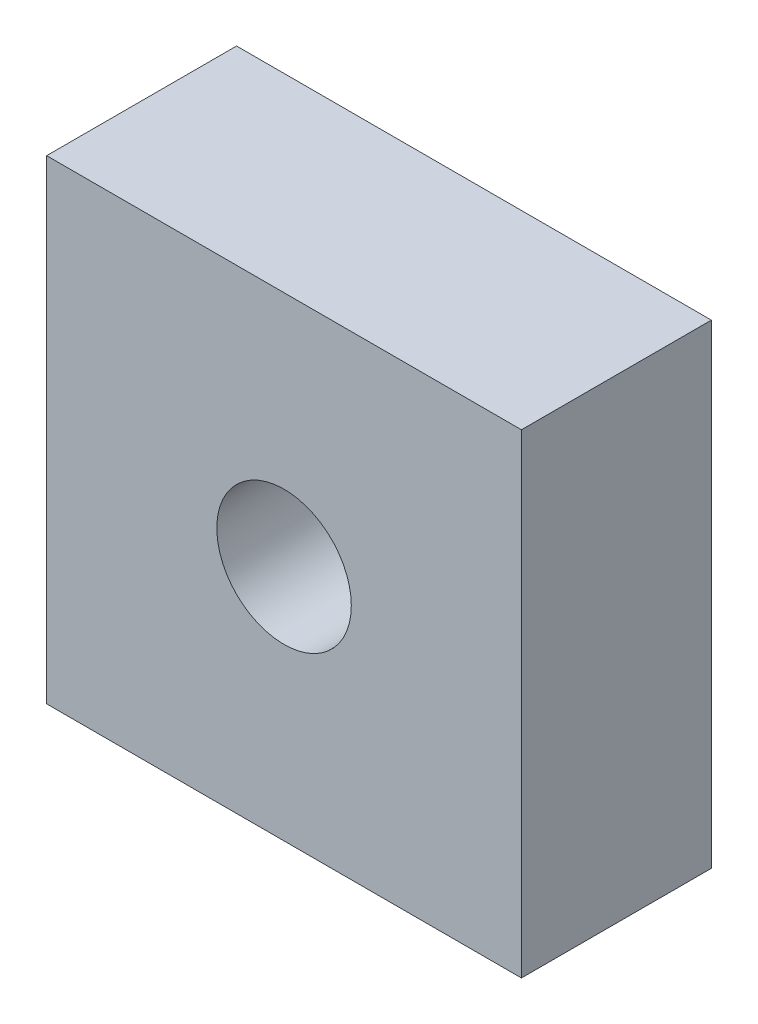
from build123d import *

# Parameters (mm, degrees)
ESQUISSE1_W          = 30
ESQUISSE1_H          = 30
ESQUISSE1_R          = 4.25
BASE_EXTRUSION_DEPTH = 12


with BuildPart() as part:
    # Esquisse1 → Base-Extrusion (new body)
    with BuildSketch(Plane.XY):
        with Locations((15, -15)):
            Rectangle(ESQUISSE1_W, ESQUISSE1_H)
        with Locations((15, -15)):
            Circle(ESQUISSE1_R, mode=Mode.SUBTRACT)
    extrude(amount=BASE_EXTRUSION_DEPTH)


solid = part.part
